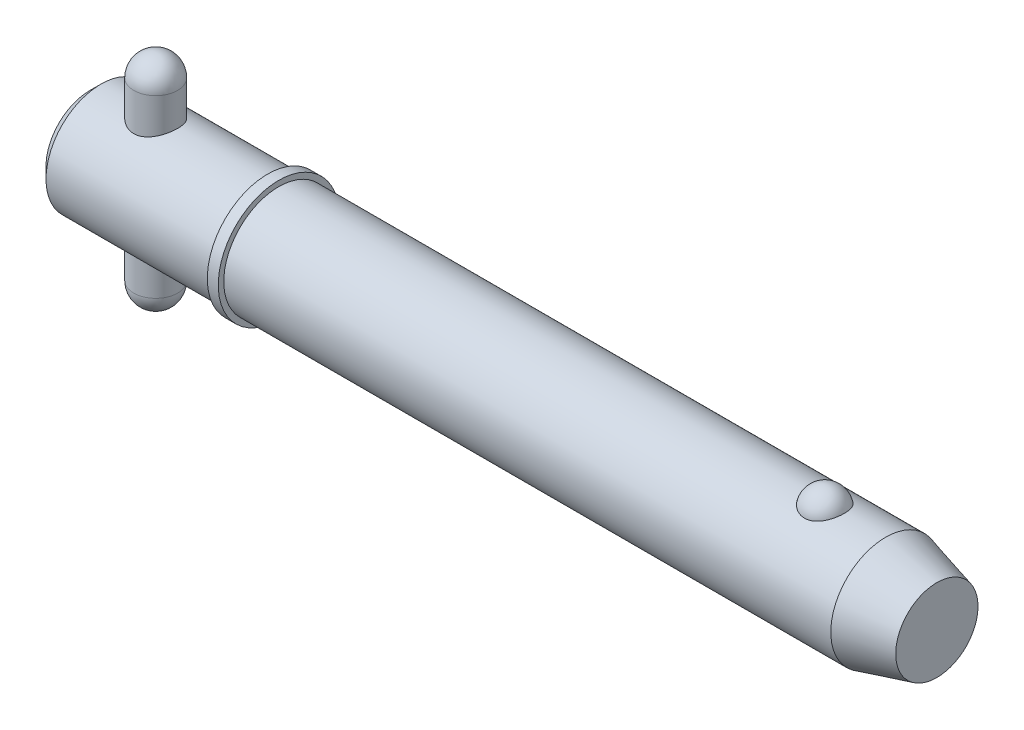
ISO-10303-21;
HEADER;
FILE_DESCRIPTION(('STEP AP214'),'2;1');
FILE_NAME('part.step','',(''),(''),'','','');
FILE_SCHEMA(('AUTOMOTIVE_DESIGN { 1 0 10303 214 1 1 1 1 }'));
ENDSEC;
DATA;
#1=APPLICATION_CONTEXT('core data for automotive mechanical design processes');
#2=APPLICATION_PROTOCOL_DEFINITION('international standard','automotive_design',2000,#1);
#3=PRODUCT_CONTEXT('',#1,'mechanical');
#4=PRODUCT('Part','Part','',(#3));
#5=PRODUCT_RELATED_PRODUCT_CATEGORY('part','',(#4));
#6=PRODUCT_DEFINITION_FORMATION('','',#4);
#7=PRODUCT_DEFINITION_CONTEXT('part definition',#1,'design');
#8=PRODUCT_DEFINITION('design','',#6,#7);
#9=PRODUCT_DEFINITION_SHAPE('','',#8);
#10=(LENGTH_UNIT() NAMED_UNIT(*) SI_UNIT(.MILLI.,.METRE.));
#11=(NAMED_UNIT(*) PLANE_ANGLE_UNIT() SI_UNIT($,.RADIAN.));
#12=(NAMED_UNIT(*) SI_UNIT($,.STERADIAN.) SOLID_ANGLE_UNIT());
#13=UNCERTAINTY_MEASURE_WITH_UNIT(LENGTH_MEASURE(1.E-05),#10,'distance_accuracy_value','');
#14=(GEOMETRIC_REPRESENTATION_CONTEXT(3) GLOBAL_UNCERTAINTY_ASSIGNED_CONTEXT((#13)) GLOBAL_UNIT_ASSIGNED_CONTEXT((#10,
#11,#12)) REPRESENTATION_CONTEXT('',''));
#15=CARTESIAN_POINT('',(0.,0.,0.));
#16=DIRECTION('',(0.,0.,1.));
#17=DIRECTION('',(1.,0.,0.));
#18=AXIS2_PLACEMENT_3D('',#15,#16,#17);
#19=CARTESIAN_POINT('',(9.525,15.875,0.));
#20=DIRECTION('',(0.,-1.,0.));
#21=DIRECTION('',(0.,0.,-1.));
#22=AXIS2_PLACEMENT_3D('',#19,#20,#21);
#23=CYLINDRICAL_SURFACE('',#22,3.175);
#24=CARTESIAN_POINT('',(9.525,-12.7,0.));
#25=DIRECTION('',(0.,-1.,0.));
#26=DIRECTION('',(0.,0.,-1.));
#27=AXIS2_PLACEMENT_3D('',#24,#25,#26);
#28=CIRCLE('',#27,3.175);
#29=CARTESIAN_POINT('',(9.525,-12.7,-3.175));
#30=VERTEX_POINT('',#29);
#31=EDGE_CURVE('P0_E10',#30,#30,#28,.F.);
#32=ORIENTED_EDGE('',*,*,#31,.T.);
#33=EDGE_LOOP('',(#32));
#34=FACE_BOUND('',#33,.T.);
#35=CARTESIAN_POINT('',(9.525,12.7,0.));
#36=DIRECTION('',(0.,-1.,0.));
#37=DIRECTION('',(0.,0.,-1.));
#38=AXIS2_PLACEMENT_3D('',#35,#36,#37);
#39=CIRCLE('',#38,3.175);
#40=CARTESIAN_POINT('',(9.525,12.7,-3.175));
#41=VERTEX_POINT('',#40);
#42=EDGE_CURVE('P0_E21',#41,#41,#39,.T.);
#43=ORIENTED_EDGE('',*,*,#42,.T.);
#44=EDGE_LOOP('',(#43));
#45=FACE_BOUND('',#44,.T.);
#46=ADVANCED_FACE('P0_F14',(#34,#45),#23,.T.);
#47=CARTESIAN_POINT('',(9.525,-12.7,0.));
#48=DIRECTION('',(0.,0.,1.));
#49=DIRECTION('',(1.,0.,0.));
#50=AXIS2_PLACEMENT_3D('',#47,#48,#49);
#51=SPHERICAL_SURFACE('',#50,3.175);
#52=CARTESIAN_POINT('',(9.525,-12.7,0.));
#53=DIRECTION('',(0.,-1.,0.));
#54=DIRECTION('',(0.,0.,-1.));
#55=AXIS2_PLACEMENT_3D('',#52,#53,#54);
#56=SPHERICAL_SURFACE('',#55,3.175);
#57=ORIENTED_EDGE('',*,*,#31,.F.);
#58=EDGE_LOOP('',(#57));
#59=FACE_BOUND('',#58,.T.);
#60=ADVANCED_FACE('P0_F29',(#59),#56,.T.);
#61=CARTESIAN_POINT('',(9.525,12.7,0.));
#62=DIRECTION('',(0.,0.,1.));
#63=DIRECTION('',(1.,0.,0.));
#64=AXIS2_PLACEMENT_3D('',#61,#62,#63);
#65=SPHERICAL_SURFACE('',#64,3.175);
#66=CARTESIAN_POINT('',(9.525,12.7,0.));
#67=DIRECTION('',(0.,-1.,0.));
#68=DIRECTION('',(0.,0.,-1.));
#69=AXIS2_PLACEMENT_3D('',#66,#67,#68);
#70=SPHERICAL_SURFACE('',#69,3.175);
#71=ORIENTED_EDGE('',*,*,#42,.F.);
#72=EDGE_LOOP('',(#71));
#73=FACE_BOUND('',#72,.T.);
#74=ADVANCED_FACE('P0_F16',(#73),#70,.T.);
#75=CLOSED_SHELL('',(#46,#60,#74));
#76=MANIFOLD_SOLID_BREP('P0_B1',#75);
#77=CARTESIAN_POINT('',(0.,0.,0.));
#78=DIRECTION('',(1.,0.,0.));
#79=DIRECTION('',(0.,0.,-1.));
#80=AXIS2_PLACEMENT_3D('',#77,#78,#79);
#81=CYLINDRICAL_SURFACE('',#80,7.94);
#82=CARTESIAN_POINT('',(115.151879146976,0.,0.));
#83=DIRECTION('',(1.,0.,0.));
#84=DIRECTION('',(0.,0.,-1.));
#85=AXIS2_PLACEMENT_3D('',#82,#83,#84);
#86=CIRCLE('',#85,7.94);
#87=CARTESIAN_POINT('',(115.151879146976,0.,-7.94));
#88=VERTEX_POINT('',#87);
#89=EDGE_CURVE('P1_E81',#88,#88,#86,.T.);
#90=ORIENTED_EDGE('',*,*,#89,.F.);
#91=EDGE_LOOP('',(#90));
#92=FACE_BOUND('',#91,.T.);
#93=CARTESIAN_POINT('',(27.31,0.,0.));
#94=DIRECTION('',(1.,0.,0.));
#95=DIRECTION('',(0.,0.,-1.));
#96=AXIS2_PLACEMENT_3D('',#93,#94,#95);
#97=CIRCLE('',#96,7.94);
#98=CARTESIAN_POINT('',(27.31,0.,-7.94));
#99=VERTEX_POINT('',#98);
#100=EDGE_CURVE('P1_E85',#99,#99,#97,.T.);
#101=ORIENTED_EDGE('',*,*,#100,.T.);
#102=EDGE_LOOP('',(#101));
#103=FACE_BOUND('',#102,.T.);
#104=CARTESIAN_POINT('',(106.344907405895,7.37767842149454,2.93486986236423));
#105=CARTESIAN_POINT('',(106.192749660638,7.3776732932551,2.93487505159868));
#106=CARTESIAN_POINT('',(106.040632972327,7.38258419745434,2.92262454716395));
#107=CARTESIAN_POINT('',(105.740928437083,7.40163229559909,2.87404196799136));
#108=CARTESIAN_POINT('',(105.593339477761,7.41576720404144,2.83771585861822));
#109=CARTESIAN_POINT('',(105.307018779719,7.4516157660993,2.74218769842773));
#110=CARTESIAN_POINT('',(105.168274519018,7.47331841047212,2.68301886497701));
#111=CARTESIAN_POINT('',(104.902882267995,7.52194082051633,2.54350967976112));
#112=CARTESIAN_POINT('',(104.776236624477,7.5488615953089,2.46316523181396));
#113=CARTESIAN_POINT('',(104.534534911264,7.60594671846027,2.28090375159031));
#114=CARTESIAN_POINT('',(104.419906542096,7.63618114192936,2.17844211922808));
#115=CARTESIAN_POINT('',(104.208878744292,7.69614046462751,1.95608495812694));
#116=CARTESIAN_POINT('',(104.112482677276,7.72586526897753,1.83618622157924));
#117=CARTESIAN_POINT('',(103.935938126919,7.78314821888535,1.57628086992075));
#118=CARTESIAN_POINT('',(103.856707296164,7.81055035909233,1.43561546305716));
#119=CARTESIAN_POINT('',(103.721797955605,7.85879631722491,1.14236334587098));
#120=CARTESIAN_POINT('',(103.666121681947,7.87963951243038,0.989775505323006));
#121=CARTESIAN_POINT('',(103.57881215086,7.91289645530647,0.67461992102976));
#122=CARTESIAN_POINT('',(103.54753090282,7.925186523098,0.511941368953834));
#123=CARTESIAN_POINT('',(103.510975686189,7.93958930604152,0.183247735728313));
#124=CARTESIAN_POINT('',(103.505701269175,7.94170219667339,0.0172327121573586));
#125=CARTESIAN_POINT('',(103.521231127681,7.93554931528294,-0.312672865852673));
#126=CARTESIAN_POINT('',(103.541925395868,7.92732732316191,-0.476569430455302));
#127=CARTESIAN_POINT('',(103.60878655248,7.90141534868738,-0.798305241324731));
#128=CARTESIAN_POINT('',(103.654953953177,7.88372517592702,-0.956144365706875));
#129=CARTESIAN_POINT('',(103.771898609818,7.84066230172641,-1.26152073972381));
#130=CARTESIAN_POINT('',(103.842704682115,7.81528060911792,-1.40904568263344));
#131=CARTESIAN_POINT('',(104.007478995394,7.7594867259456,-1.68950598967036));
#132=CARTESIAN_POINT('',(104.101448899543,7.72907417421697,-1.82244030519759));
#133=CARTESIAN_POINT('',(104.310839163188,7.66640424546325,-2.07032792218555));
#134=CARTESIAN_POINT('',(104.426315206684,7.63414223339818,-2.1852330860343));
#135=CARTESIAN_POINT('',(104.6759006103,7.57149681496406,-2.39329737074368));
#136=CARTESIAN_POINT('',(104.810008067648,7.54111321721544,-2.48645870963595));
#137=CARTESIAN_POINT('',(105.090111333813,7.48650742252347,-2.64628132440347));
#138=CARTESIAN_POINT('',(105.235760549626,7.46215900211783,-2.71350554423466));
#139=CARTESIAN_POINT('',(105.537425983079,7.42171253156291,-2.82226614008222));
#140=CARTESIAN_POINT('',(105.693438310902,7.40561140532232,-2.86381209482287));
#141=CARTESIAN_POINT('',(106.002970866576,7.3842679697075,-2.91839077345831));
#142=CARTESIAN_POINT('',(106.156222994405,7.37852109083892,-2.93275024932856));
#143=CARTESIAN_POINT('',(106.463070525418,7.37700973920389,-2.93655208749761));
#144=CARTESIAN_POINT('',(106.616665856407,7.38124333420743,-2.92599927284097));
#145=CARTESIAN_POINT('',(106.914990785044,7.39890635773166,-2.88102897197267));
#146=CARTESIAN_POINT('',(107.059848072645,7.41205491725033,-2.8473399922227));
#147=CARTESIAN_POINT('',(107.34164329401,7.445801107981,-2.75788206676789));
#148=CARTESIAN_POINT('',(107.478580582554,7.46639934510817,-2.70211132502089));
#149=CARTESIAN_POINT('',(107.744061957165,7.51339098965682,-2.56858908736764));
#150=CARTESIAN_POINT('',(107.872354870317,7.53990200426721,-2.49038067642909));
#151=CARTESIAN_POINT('',(108.114244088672,7.59569503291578,-2.31462737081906));
#152=CARTESIAN_POINT('',(108.227837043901,7.62497767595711,-2.21707808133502));
#153=CARTESIAN_POINT('',(108.44322156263,7.68489473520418,-1.99982049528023));
#154=CARTESIAN_POINT('',(108.544148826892,7.71552419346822,-1.87925337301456));
#155=CARTESIAN_POINT('',(108.725186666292,7.77353016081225,-1.62268826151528));
#156=CARTESIAN_POINT('',(108.805293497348,7.80090608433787,-1.4866875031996));
#157=CARTESIAN_POINT('',(108.945361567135,7.85047992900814,-1.19818413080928));
#158=CARTESIAN_POINT('',(109.004587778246,7.8724818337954,-1.04529016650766));
#159=CARTESIAN_POINT('',(109.097982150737,7.90785114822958,-0.731080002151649));
#160=CARTESIAN_POINT('',(109.132149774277,7.92121837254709,-0.569763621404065));
#161=CARTESIAN_POINT('',(109.174795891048,7.93797834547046,-0.242812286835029));
#162=CARTESIAN_POINT('',(109.183204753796,7.94134405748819,-0.0771668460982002));
#163=CARTESIAN_POINT('',(109.173962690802,7.93767937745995,0.2532769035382));
#164=CARTESIAN_POINT('',(109.156312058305,7.93064910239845,0.418075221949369));
#165=CARTESIAN_POINT('',(109.095424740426,7.90695571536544,0.74152553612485));
#166=CARTESIAN_POINT('',(109.052281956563,7.8903279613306,0.900197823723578));
#167=CARTESIAN_POINT('',(108.94135358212,7.84916386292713,1.20759654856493));
#168=CARTESIAN_POINT('',(108.87356656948,7.82462706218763,1.35632241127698));
#169=CARTESIAN_POINT('',(108.714371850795,7.7700669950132,1.64032869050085));
#170=CARTESIAN_POINT('',(108.622861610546,7.7400200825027,1.77554712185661));
#171=CARTESIAN_POINT('',(108.418296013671,7.67774175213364,2.02800648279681));
#172=CARTESIAN_POINT('',(108.305241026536,7.64551037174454,2.14524772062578));
#173=CARTESIAN_POINT('',(108.060831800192,7.58265895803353,2.35778002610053));
#174=CARTESIAN_POINT('',(107.929583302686,7.5520309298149,2.45319004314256));
#175=CARTESIAN_POINT('',(107.651601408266,7.49579792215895,2.61999897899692));
#176=CARTESIAN_POINT('',(107.504867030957,7.47019326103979,2.69139637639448));
#177=CARTESIAN_POINT('',(107.192947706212,7.42622216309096,2.8105324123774));
#178=CARTESIAN_POINT('',(107.027220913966,7.40825002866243,2.85700910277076));
#179=CARTESIAN_POINT('',(106.689279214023,7.38398348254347,2.9191685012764));
#180=CARTESIAN_POINT('',(106.51706702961,7.3776842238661,2.93486399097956));
#181=CARTESIAN_POINT('',(106.344907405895,7.37767842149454,2.93486986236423));
#182=B_SPLINE_CURVE_WITH_KNOTS('',3,(#104,#105,#106,#107,#108,#109,#110,#111,#112,#113,#114,
#115,#116,#117,#118,#119,#120,#121,#122,#123,#124,#125,#126,#127,#128,#129,#130,#131,#132,#133,
#134,#135,#136,#137,#138,#139,#140,#141,#142,#143,#144,#145,#146,#147,#148,#149,#150,#151,#152,
#153,#154,#155,#156,#157,#158,#159,#160,#161,#162,#163,#164,#165,#166,#167,#168,#169,#170,#171,
#172,#173,#174,#175,#176,#177,#178,#179,#180,#181),.UNSPECIFIED.,.T.,.F.,(4,2,2,2,2,2,2,2,2,2,2,
2,2,2,2,2,2,2,2,2,2,2,2,2,2,2,2,2,2,2,2,2,2,2,2,2,2,2,4),(0.,0.45584132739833,0.911569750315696,
1.36663794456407,1.8217942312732,2.28978983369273,2.7578716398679,3.246853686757,
3.73588214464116,4.23184282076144,4.72779494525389,5.22165321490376,5.71552141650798,
6.20996917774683,6.70445245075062,7.20023431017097,7.69596557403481,8.18023418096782,
8.66432203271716,9.12410697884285,9.58380291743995,10.0296503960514,10.4755341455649,
10.9312349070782,11.3870393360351,11.8654416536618,12.3439299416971,12.8378875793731,
13.3318558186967,13.8271581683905,14.3224549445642,14.8159385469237,15.3094506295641,
15.8051323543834,16.3008055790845,16.7937101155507,17.2866458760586,17.8026240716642,
18.3183879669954),.UNSPECIFIED.);
#183=CARTESIAN_POINT('',(106.344907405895,7.37767842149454,2.93486986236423));
#184=VERTEX_POINT('',#183);
#185=EDGE_CURVE('P1_E35',#184,#184,#182,.T.);
#186=ORIENTED_EDGE('',*,*,#185,.T.);
#187=EDGE_LOOP('',(#186));
#188=FACE_BOUND('',#187,.T.);
#189=ADVANCED_FACE('P1_F13',(#92,#103,#188),#81,.T.);
#190=CARTESIAN_POINT('',(0.,0.,0.));
#191=DIRECTION('',(-1.,0.,0.));
#192=DIRECTION('',(0.,0.,1.));
#193=AXIS2_PLACEMENT_3D('',#190,#191,#192);
#194=PLANE('',#193);
#195=CARTESIAN_POINT('',(0.,0.,0.));
#196=DIRECTION('',(1.,0.,0.));
#197=DIRECTION('',(0.,0.,-1.));
#198=AXIS2_PLACEMENT_3D('',#195,#196,#197);
#199=CIRCLE('',#198,6.352);
#200=CARTESIAN_POINT('',(0.,0.,-6.352));
#201=VERTEX_POINT('',#200);
#202=EDGE_CURVE('P1_E9',#201,#201,#199,.T.);
#203=ORIENTED_EDGE('',*,*,#202,.F.);
#204=EDGE_LOOP('',(#203));
#205=FACE_BOUND('',#204,.T.);
#206=ADVANCED_FACE('P1_F15',(#205),#194,.T.);
#207=CARTESIAN_POINT('',(1.58799999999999,0.,0.));
#208=DIRECTION('',(1.,0.,0.));
#209=DIRECTION('',(0.,0.,-1.));
#210=AXIS2_PLACEMENT_3D('',#207,#208,#209);
#211=CONICAL_SURFACE('',#210,7.94,0.78539816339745);
#212=ORIENTED_EDGE('',*,*,#202,.T.);
#213=EDGE_LOOP('',(#212));
#214=FACE_BOUND('',#213,.T.);
#215=CARTESIAN_POINT('',(1.58799999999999,0.,0.));
#216=DIRECTION('',(1.,0.,0.));
#217=DIRECTION('',(0.,0.,-1.));
#218=AXIS2_PLACEMENT_3D('',#215,#216,#217);
#219=CIRCLE('',#218,7.94);
#220=CARTESIAN_POINT('',(1.58799999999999,0.,-7.94));
#221=VERTEX_POINT('',#220);
#222=EDGE_CURVE('P1_E26',#221,#221,#219,.T.);
#223=ORIENTED_EDGE('',*,*,#222,.F.);
#224=EDGE_LOOP('',(#223));
#225=FACE_BOUND('',#224,.T.);
#226=ADVANCED_FACE('P1_F77',(#214,#225),#211,.T.);
#227=CARTESIAN_POINT('',(0.,0.,0.));
#228=DIRECTION('',(1.,0.,0.));
#229=DIRECTION('',(0.,0.,-1.));
#230=AXIS2_PLACEMENT_3D('',#227,#228,#229);
#231=CYLINDRICAL_SURFACE('',#230,7.94);
#232=CARTESIAN_POINT('',(9.525,-7.27756655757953,3.175));
#233=CARTESIAN_POINT('',(9.43992346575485,-7.27756715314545,3.17499935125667));
#234=CARTESIAN_POINT('',(9.35481882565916,-7.27906496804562,3.1715736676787));
#235=CARTESIAN_POINT('',(9.18524505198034,-7.28499816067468,3.15791803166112));
#236=CARTESIAN_POINT('',(9.100776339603,-7.28943533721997,3.14768391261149));
#237=CARTESIAN_POINT('',(8.84895715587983,-7.30698881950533,3.10684226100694));
#238=CARTESIAN_POINT('',(8.6834173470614,-7.32434654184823,3.06609574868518));
#239=CARTESIAN_POINT('',(8.36278910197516,-7.36806950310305,2.95945910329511));
#240=CARTESIAN_POINT('',(8.20766386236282,-7.39440078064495,2.89366366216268));
#241=CARTESIAN_POINT('',(7.91065319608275,-7.45304562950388,2.73907413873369));
#242=CARTESIAN_POINT('',(7.76876488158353,-7.48535789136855,2.65028508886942));
#243=CARTESIAN_POINT('',(7.49411086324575,-7.55439482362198,2.44679888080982));
#244=CARTESIAN_POINT('',(7.36219910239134,-7.59126138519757,2.33099745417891));
#245=CARTESIAN_POINT('',(7.11904234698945,-7.66408045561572,2.07909838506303));
#246=CARTESIAN_POINT('',(7.00780457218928,-7.70003264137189,1.94299368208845));
#247=CARTESIAN_POINT('',(6.80492173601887,-7.76867514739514,1.64775981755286));
#248=CARTESIAN_POINT('',(6.71422139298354,-7.80118112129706,1.48793473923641));
#249=CARTESIAN_POINT('',(6.56135788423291,-7.85754918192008,1.15376269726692));
#250=CARTESIAN_POINT('',(6.49918311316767,-7.88141478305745,0.979421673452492));
#251=CARTESIAN_POINT('',(6.40818142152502,-7.91680873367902,0.630115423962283));
#252=CARTESIAN_POINT('',(6.3778864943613,-7.9288781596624,0.455588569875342));
#253=CARTESIAN_POINT('',(6.34677743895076,-7.94127547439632,0.103539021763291));
#254=CARTESIAN_POINT('',(6.34595232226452,-7.94160773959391,-0.0739825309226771));
#255=CARTESIAN_POINT('',(6.37300128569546,-7.93082261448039,-0.416371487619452));
#256=CARTESIAN_POINT('',(6.39926693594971,-7.92034690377,-0.581389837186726));
#257=CARTESIAN_POINT('',(6.47701615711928,-7.88998770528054,-0.904449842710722));
#258=CARTESIAN_POINT('',(6.52850157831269,-7.87010352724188,-1.06249098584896));
#259=CARTESIAN_POINT('',(6.65586120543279,-7.82249343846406,-1.36995769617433));
#260=CARTESIAN_POINT('',(6.73209124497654,-7.79465387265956,-1.51921754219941));
#261=CARTESIAN_POINT('',(6.90644286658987,-7.73389606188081,-1.80321183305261));
#262=CARTESIAN_POINT('',(7.00457194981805,-7.70097607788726,-1.93794127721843));
#263=CARTESIAN_POINT('',(7.22744086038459,-7.63084889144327,-2.19843606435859));
#264=CARTESIAN_POINT('',(7.35350432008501,-7.59350211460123,-2.3230330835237));
#265=CARTESIAN_POINT('',(7.62488266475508,-7.52039654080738,-2.54979642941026));
#266=CARTESIAN_POINT('',(7.77020381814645,-7.48463826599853,-2.65195542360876));
#267=CARTESIAN_POINT('',(8.08119298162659,-7.41780943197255,-2.83361305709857));
#268=CARTESIAN_POINT('',(8.24731937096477,-7.38689959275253,-2.91239105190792));
#269=CARTESIAN_POINT('',(8.59204539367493,-7.33515216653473,-3.04038913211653));
#270=CARTESIAN_POINT('',(8.77063684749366,-7.31430804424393,-3.08962840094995));
#271=CARTESIAN_POINT('',(9.12356982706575,-7.28663831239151,-3.15431018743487));
#272=CARTESIAN_POINT('',(9.29750494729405,-7.2790344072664,-3.17163284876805));
#273=CARTESIAN_POINT('',(9.64592502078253,-7.27648884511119,-3.17747282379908));
#274=CARTESIAN_POINT('',(9.82040979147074,-7.28154335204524,-3.16599886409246));
#275=CARTESIAN_POINT('',(10.1545374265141,-7.30294638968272,-3.11628310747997));
#276=CARTESIAN_POINT('',(10.3144598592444,-7.31863587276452,-3.0796016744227));
#277=CARTESIAN_POINT('',(10.625774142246,-7.35872371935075,-2.98253618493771));
#278=CARTESIAN_POINT('',(10.7771640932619,-7.38312401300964,-2.92214687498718));
#279=CARTESIAN_POINT('',(11.0739599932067,-7.4390944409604,-2.77664664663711));
#280=CARTESIAN_POINT('',(11.2188745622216,-7.47091513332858,-2.69063278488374));
#281=CARTESIAN_POINT('',(11.4928722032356,-7.53775867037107,-2.49724834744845));
#282=CARTESIAN_POINT('',(11.6219487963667,-7.57278281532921,-2.38986907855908));
#283=CARTESIAN_POINT('',(11.8705091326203,-7.64520845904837,-2.1474449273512));
#284=CARTESIAN_POINT('',(11.9885816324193,-7.68259462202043,-2.01094304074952));
#285=CARTESIAN_POINT('',(12.2003631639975,-7.75309951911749,-1.71917041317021));
#286=CARTESIAN_POINT('',(12.2940712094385,-7.78621808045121,-1.56389891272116));
#287=CARTESIAN_POINT('',(12.4541161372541,-7.84456050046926,-1.23845027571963));
#288=CARTESIAN_POINT('',(12.5204600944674,-7.86978639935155,-1.06827700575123));
#289=CARTESIAN_POINT('',(12.6231407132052,-7.90943635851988,-0.717928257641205));
#290=CARTESIAN_POINT('',(12.6594936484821,-7.92386627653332,-0.537758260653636));
#291=CARTESIAN_POINT('',(12.6992281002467,-7.93967263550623,-0.185201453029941));
#292=CARTESIAN_POINT('',(12.7046050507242,-7.94183891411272,-0.0130732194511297));
#293=CARTESIAN_POINT('',(12.6875036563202,-7.9350072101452,0.329549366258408));
#294=CARTESIAN_POINT('',(12.6650295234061,-7.92601091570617,0.500043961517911));
#295=CARTESIAN_POINT('',(12.5942896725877,-7.89825976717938,0.829196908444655));
#296=CARTESIAN_POINT('',(12.5468364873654,-7.87981280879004,0.988057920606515));
#297=CARTESIAN_POINT('',(12.4283390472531,-7.83513565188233,1.29553461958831));
#298=CARTESIAN_POINT('',(12.3572904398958,-7.8089040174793,1.44414841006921));
#299=CARTESIAN_POINT('',(12.1900822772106,-7.7497911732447,1.73412879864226));
#300=CARTESIAN_POINT('',(12.0929519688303,-7.71666737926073,1.87488510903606));
#301=CARTESIAN_POINT('',(11.8777894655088,-7.64775894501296,2.13869231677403));
#302=CARTESIAN_POINT('',(11.7597486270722,-7.61197320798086,2.26173585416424));
#303=CARTESIAN_POINT('',(11.4974896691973,-7.53902341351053,2.49449755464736));
#304=CARTESIAN_POINT('',(11.3521039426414,-7.50191102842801,2.60292060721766));
#305=CARTESIAN_POINT('',(11.0440201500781,-7.43289551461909,2.79392602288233));
#306=CARTESIAN_POINT('',(10.8813200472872,-7.40099299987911,2.87650534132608));
#307=CARTESIAN_POINT('',(10.558064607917,-7.3489506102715,3.00682739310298));
#308=CARTESIAN_POINT('',(10.398627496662,-7.32801197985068,3.05703164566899));
#309=CARTESIAN_POINT('',(10.0731242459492,-7.29639491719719,3.13175843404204));
#310=CARTESIAN_POINT('',(9.90707793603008,-7.28568789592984,3.15635254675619));
#311=CARTESIAN_POINT('',(9.70441566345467,-7.27968826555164,3.17013149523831));
#312=CARTESIAN_POINT('',(9.66856669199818,-7.27889378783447,3.17195593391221));
#313=CARTESIAN_POINT('',(9.59681348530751,-7.27783278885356,3.17439036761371));
#314=CARTESIAN_POINT('',(9.56090924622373,-7.27756630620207,3.17500027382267));
#315=CARTESIAN_POINT('',(9.525,-7.27756655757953,3.175));
#316=B_SPLINE_CURVE_WITH_KNOTS('',3,(#232,#233,#234,#235,#236,#237,#238,#239,#240,#241,#242,
#243,#244,#245,#246,#247,#248,#249,#250,#251,#252,#253,#254,#255,#256,#257,#258,#259,#260,#261,
#262,#263,#264,#265,#266,#267,#268,#269,#270,#271,#272,#273,#274,#275,#276,#277,#278,#279,#280,
#281,#282,#283,#284,#285,#286,#287,#288,#289,#290,#291,#292,#293,#294,#295,#296,#297,#298,#299,
#300,#301,#302,#303,#304,#305,#306,#307,#308,#309,#310,#311,#312,#313,#314,#315),.UNSPECIFIED.,
.T.,.F.,(4,2,2,2,2,2,2,2,2,2,2,2,2,2,2,2,2,2,2,2,2,2,2,2,2,2,2,2,2,2,2,2,2,2,2,2,2,2,2,2,2,4),
(0.,0.255187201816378,0.510530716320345,1.0218798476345,1.53131482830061,2.04063840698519,
2.57635929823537,3.11226692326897,3.66929090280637,4.22608806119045,4.75594400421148,
5.28560237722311,5.78552836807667,6.28549104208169,6.79298787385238,7.30065880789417,
7.8416422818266,8.38280228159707,8.93923025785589,9.49529647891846,10.0174074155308,
10.5393601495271,11.0316114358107,11.5239718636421,12.0362920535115,12.5488211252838,
13.0991799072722,13.6495609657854,14.1997996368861,14.7497395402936,15.2638187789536,
15.7778202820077,16.2760504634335,16.7743726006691,17.294711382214,17.8152657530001,
18.3680208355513,18.9208410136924,19.4240423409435,19.9258334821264,20.0335354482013,
20.1412452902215),.UNSPECIFIED.);
#317=CARTESIAN_POINT('',(9.525,-7.27756655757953,3.175));
#318=VERTEX_POINT('',#317);
#319=EDGE_CURVE('P1_E17',#318,#318,#316,.T.);
#320=ORIENTED_EDGE('',*,*,#319,.F.);
#321=EDGE_LOOP('',(#320));
#322=FACE_BOUND('',#321,.T.);
#323=CARTESIAN_POINT('',(9.525,7.27756655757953,3.175));
#324=CARTESIAN_POINT('',(9.61007653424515,7.27756715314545,3.17499935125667));
#325=CARTESIAN_POINT('',(9.69518117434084,7.27906496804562,3.1715736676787));
#326=CARTESIAN_POINT('',(9.86475494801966,7.28499816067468,3.15791803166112));
#327=CARTESIAN_POINT('',(9.949223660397,7.28943533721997,3.14768391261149));
#328=CARTESIAN_POINT('',(10.2010428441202,7.30698881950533,3.10684226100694));
#329=CARTESIAN_POINT('',(10.3665826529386,7.32434654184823,3.06609574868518));
#330=CARTESIAN_POINT('',(10.6872108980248,7.36806950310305,2.95945910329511));
#331=CARTESIAN_POINT('',(10.8423361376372,7.39440078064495,2.89366366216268));
#332=CARTESIAN_POINT('',(11.1393468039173,7.45304562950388,2.73907413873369));
#333=CARTESIAN_POINT('',(11.2812351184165,7.48535789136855,2.65028508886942));
#334=CARTESIAN_POINT('',(11.5558891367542,7.55439482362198,2.44679888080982));
#335=CARTESIAN_POINT('',(11.6878008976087,7.59126138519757,2.33099745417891));
#336=CARTESIAN_POINT('',(11.9309576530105,7.66408045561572,2.07909838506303));
#337=CARTESIAN_POINT('',(12.0421954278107,7.70003264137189,1.94299368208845));
#338=CARTESIAN_POINT('',(12.2450782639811,7.76867514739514,1.64775981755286));
#339=CARTESIAN_POINT('',(12.3357786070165,7.80118112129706,1.48793473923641));
#340=CARTESIAN_POINT('',(12.4886421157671,7.85754918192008,1.15376269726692));
#341=CARTESIAN_POINT('',(12.5508168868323,7.88141478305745,0.979421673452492));
#342=CARTESIAN_POINT('',(12.641818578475,7.91680873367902,0.630115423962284));
#343=CARTESIAN_POINT('',(12.6721135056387,7.9288781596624,0.455588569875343));
#344=CARTESIAN_POINT('',(12.7032225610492,7.94127547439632,0.103539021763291));
#345=CARTESIAN_POINT('',(12.7040476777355,7.94160773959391,-0.0739825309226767));
#346=CARTESIAN_POINT('',(12.6769987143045,7.93082261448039,-0.416371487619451));
#347=CARTESIAN_POINT('',(12.6507330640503,7.92034690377,-0.581389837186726));
#348=CARTESIAN_POINT('',(12.5729838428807,7.88998770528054,-0.904449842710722));
#349=CARTESIAN_POINT('',(12.5214984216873,7.87010352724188,-1.06249098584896));
#350=CARTESIAN_POINT('',(12.3941387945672,7.82249343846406,-1.36995769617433));
#351=CARTESIAN_POINT('',(12.3179087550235,7.79465387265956,-1.51921754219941));
#352=CARTESIAN_POINT('',(12.1435571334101,7.73389606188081,-1.80321183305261));
#353=CARTESIAN_POINT('',(12.0454280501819,7.70097607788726,-1.93794127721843));
#354=CARTESIAN_POINT('',(11.8225591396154,7.63084889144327,-2.19843606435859));
#355=CARTESIAN_POINT('',(11.696495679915,7.59350211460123,-2.3230330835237));
#356=CARTESIAN_POINT('',(11.4251173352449,7.52039654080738,-2.54979642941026));
#357=CARTESIAN_POINT('',(11.2797961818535,7.48463826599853,-2.65195542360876));
#358=CARTESIAN_POINT('',(10.9688070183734,7.41780943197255,-2.83361305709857));
#359=CARTESIAN_POINT('',(10.8026806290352,7.38689959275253,-2.91239105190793));
#360=CARTESIAN_POINT('',(10.4579546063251,7.33515216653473,-3.04038913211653));
#361=CARTESIAN_POINT('',(10.2793631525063,7.31430804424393,-3.08962840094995));
#362=CARTESIAN_POINT('',(9.92643017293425,7.28663831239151,-3.15431018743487));
#363=CARTESIAN_POINT('',(9.75249505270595,7.2790344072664,-3.17163284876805));
#364=CARTESIAN_POINT('',(9.40407497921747,7.2764888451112,-3.17747282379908));
#365=CARTESIAN_POINT('',(9.22959020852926,7.28154335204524,-3.16599886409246));
#366=CARTESIAN_POINT('',(8.89546257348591,7.30294638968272,-3.11628310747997));
#367=CARTESIAN_POINT('',(8.73554014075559,7.31863587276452,-3.0796016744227));
#368=CARTESIAN_POINT('',(8.42422585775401,7.35872371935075,-2.98253618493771));
#369=CARTESIAN_POINT('',(8.27283590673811,7.38312401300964,-2.92214687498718));
#370=CARTESIAN_POINT('',(7.97604000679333,7.4390944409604,-2.77664664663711));
#371=CARTESIAN_POINT('',(7.83112543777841,7.47091513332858,-2.69063278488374));
#372=CARTESIAN_POINT('',(7.55712779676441,7.53775867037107,-2.49724834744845));
#373=CARTESIAN_POINT('',(7.42805120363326,7.57278281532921,-2.38986907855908));
#374=CARTESIAN_POINT('',(7.17949086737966,7.64520845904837,-2.1474449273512));
#375=CARTESIAN_POINT('',(7.06141836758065,7.68259462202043,-2.01094304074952));
#376=CARTESIAN_POINT('',(6.8496368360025,7.75309951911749,-1.71917041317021));
#377=CARTESIAN_POINT('',(6.75592879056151,7.78621808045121,-1.56389891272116));
#378=CARTESIAN_POINT('',(6.59588386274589,7.84456050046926,-1.23845027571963));
#379=CARTESIAN_POINT('',(6.52953990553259,7.86978639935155,-1.06827700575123));
#380=CARTESIAN_POINT('',(6.42685928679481,7.90943635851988,-0.717928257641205));
#381=CARTESIAN_POINT('',(6.39050635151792,7.92386627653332,-0.537758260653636));
#382=CARTESIAN_POINT('',(6.35077189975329,7.93967263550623,-0.18520145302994));
#383=CARTESIAN_POINT('',(6.34539494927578,7.94183891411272,-0.0130732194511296));
#384=CARTESIAN_POINT('',(6.36249634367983,7.9350072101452,0.329549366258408));
#385=CARTESIAN_POINT('',(6.38497047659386,7.92601091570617,0.500043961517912));
#386=CARTESIAN_POINT('',(6.45571032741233,7.89825976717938,0.829196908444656));
#387=CARTESIAN_POINT('',(6.50316351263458,7.87981280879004,0.988057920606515));
#388=CARTESIAN_POINT('',(6.62166095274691,7.83513565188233,1.29553461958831));
#389=CARTESIAN_POINT('',(6.69270956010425,7.8089040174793,1.44414841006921));
#390=CARTESIAN_POINT('',(6.85991772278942,7.7497911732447,1.73412879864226));
#391=CARTESIAN_POINT('',(6.95704803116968,7.71666737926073,1.87488510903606));
#392=CARTESIAN_POINT('',(7.17221053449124,7.64775894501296,2.13869231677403));
#393=CARTESIAN_POINT('',(7.29025137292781,7.61197320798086,2.26173585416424));
#394=CARTESIAN_POINT('',(7.55251033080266,7.53902341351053,2.49449755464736));
#395=CARTESIAN_POINT('',(7.69789605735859,7.50191102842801,2.60292060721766));
#396=CARTESIAN_POINT('',(8.00597984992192,7.43289551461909,2.79392602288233));
#397=CARTESIAN_POINT('',(8.16867995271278,7.40099299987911,2.87650534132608));
#398=CARTESIAN_POINT('',(8.49193539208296,7.3489506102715,3.00682739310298));
#399=CARTESIAN_POINT('',(8.65137250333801,7.32801197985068,3.05703164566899));
#400=CARTESIAN_POINT('',(8.97687575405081,7.29639491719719,3.13175843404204));
#401=CARTESIAN_POINT('',(9.14292206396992,7.28568789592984,3.15635254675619));
#402=CARTESIAN_POINT('',(9.34558433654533,7.27968826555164,3.17013149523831));
#403=CARTESIAN_POINT('',(9.38143330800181,7.27889378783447,3.17195593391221));
#404=CARTESIAN_POINT('',(9.45318651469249,7.27783278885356,3.17439036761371));
#405=CARTESIAN_POINT('',(9.48909075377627,7.27756630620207,3.17500027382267));
#406=CARTESIAN_POINT('',(9.525,7.27756655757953,3.175));
#407=B_SPLINE_CURVE_WITH_KNOTS('',3,(#323,#324,#325,#326,#327,#328,#329,#330,#331,#332,#333,
#334,#335,#336,#337,#338,#339,#340,#341,#342,#343,#344,#345,#346,#347,#348,#349,#350,#351,#352,
#353,#354,#355,#356,#357,#358,#359,#360,#361,#362,#363,#364,#365,#366,#367,#368,#369,#370,#371,
#372,#373,#374,#375,#376,#377,#378,#379,#380,#381,#382,#383,#384,#385,#386,#387,#388,#389,#390,
#391,#392,#393,#394,#395,#396,#397,#398,#399,#400,#401,#402,#403,#404,#405,#406),.UNSPECIFIED.,
.T.,.F.,(4,2,2,2,2,2,2,2,2,2,2,2,2,2,2,2,2,2,2,2,2,2,2,2,2,2,2,2,2,2,2,2,2,2,2,2,2,2,2,2,2,4),
(0.,0.255187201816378,0.510530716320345,1.0218798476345,1.53131482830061,2.04063840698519,
2.57635929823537,3.11226692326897,3.66929090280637,4.22608806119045,4.75594400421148,
5.2856023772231,5.78552836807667,6.28549104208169,6.79298787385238,7.30065880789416,
7.8416422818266,8.38280228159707,8.9392302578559,9.49529647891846,10.0174074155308,
10.5393601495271,11.0316114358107,11.5239718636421,12.0362920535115,12.5488211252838,
13.0991799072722,13.6495609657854,14.1997996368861,14.7497395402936,15.2638187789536,
15.7778202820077,16.2760504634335,16.7743726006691,17.294711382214,17.8152657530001,
18.3680208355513,18.9208410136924,19.4240423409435,19.9258334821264,20.0335354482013,
20.1412452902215),.UNSPECIFIED.);
#408=CARTESIAN_POINT('',(9.525,7.27756655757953,3.175));
#409=VERTEX_POINT('',#408);
#410=EDGE_CURVE('P1_E43',#409,#409,#407,.T.);
#411=ORIENTED_EDGE('',*,*,#410,.F.);
#412=EDGE_LOOP('',(#411));
#413=FACE_BOUND('',#412,.T.);
#414=ORIENTED_EDGE('',*,*,#222,.T.);
#415=EDGE_LOOP('',(#414));
#416=FACE_BOUND('',#415,.T.);
#417=CARTESIAN_POINT('',(25.722,0.,0.));
#418=DIRECTION('',(1.,0.,0.));
#419=DIRECTION('',(0.,0.,-1.));
#420=AXIS2_PLACEMENT_3D('',#417,#418,#419);
#421=CIRCLE('',#420,7.94);
#422=CARTESIAN_POINT('',(25.722,0.,-7.94));
#423=VERTEX_POINT('',#422);
#424=EDGE_CURVE('P1_E31',#423,#423,#421,.T.);
#425=ORIENTED_EDGE('',*,*,#424,.F.);
#426=EDGE_LOOP('',(#425));
#427=FACE_BOUND('',#426,.T.);
#428=ADVANCED_FACE('P1_F103',(#322,#413,#416,#427),#231,.T.);
#429=CARTESIAN_POINT('',(25.722,7.94,0.));
#430=DIRECTION('',(-1.,0.,0.));
#431=DIRECTION('',(0.,0.,1.));
#432=AXIS2_PLACEMENT_3D('',#429,#430,#431);
#433=PLANE('',#432);
#434=ORIENTED_EDGE('',*,*,#424,.T.);
#435=EDGE_LOOP('',(#434));
#436=FACE_BOUND('',#435,.T.);
#437=CARTESIAN_POINT('',(25.722,0.,0.));
#438=DIRECTION('',(1.,0.,0.));
#439=DIRECTION('',(0.,0.,-1.));
#440=AXIS2_PLACEMENT_3D('',#437,#438,#439);
#441=CIRCLE('',#440,8.734);
#442=CARTESIAN_POINT('',(25.722,0.,-8.734));
#443=VERTEX_POINT('',#442);
#444=EDGE_CURVE('P1_E91',#443,#443,#441,.T.);
#445=ORIENTED_EDGE('',*,*,#444,.F.);
#446=EDGE_LOOP('',(#445));
#447=FACE_BOUND('',#446,.T.);
#448=ADVANCED_FACE('P1_F100',(#436,#447),#433,.T.);
#449=CARTESIAN_POINT('',(0.,0.,0.));
#450=DIRECTION('',(1.,0.,0.));
#451=DIRECTION('',(0.,0.,-1.));
#452=AXIS2_PLACEMENT_3D('',#449,#450,#451);
#453=CYLINDRICAL_SURFACE('',#452,8.734);
#454=ORIENTED_EDGE('',*,*,#444,.T.);
#455=EDGE_LOOP('',(#454));
#456=FACE_BOUND('',#455,.T.);
#457=CARTESIAN_POINT('',(27.31,0.,0.));
#458=DIRECTION('',(1.,0.,0.));
#459=DIRECTION('',(0.,0.,-1.));
#460=AXIS2_PLACEMENT_3D('',#457,#458,#459);
#461=CIRCLE('',#460,8.734);
#462=CARTESIAN_POINT('',(27.31,0.,-8.734));
#463=VERTEX_POINT('',#462);
#464=EDGE_CURVE('P1_E88',#463,#463,#461,.T.);
#465=ORIENTED_EDGE('',*,*,#464,.F.);
#466=EDGE_LOOP('',(#465));
#467=FACE_BOUND('',#466,.T.);
#468=ADVANCED_FACE('P1_F68',(#456,#467),#453,.T.);
#469=CARTESIAN_POINT('',(27.31,8.734,0.));
#470=DIRECTION('',(1.,0.,0.));
#471=DIRECTION('',(0.,0.,-1.));
#472=AXIS2_PLACEMENT_3D('',#469,#470,#471);
#473=PLANE('',#472);
#474=ORIENTED_EDGE('',*,*,#464,.T.);
#475=EDGE_LOOP('',(#474));
#476=FACE_BOUND('',#475,.T.);
#477=ORIENTED_EDGE('',*,*,#100,.F.);
#478=EDGE_LOOP('',(#477));
#479=FACE_BOUND('',#478,.T.);
#480=ADVANCED_FACE('P1_F62',(#476,#479),#473,.T.);
#481=CARTESIAN_POINT('',(122.56,0.,0.));
#482=DIRECTION('',(-1.,0.,0.));
#483=DIRECTION('',(0.,0.,1.));
#484=AXIS2_PLACEMENT_3D('',#481,#482,#483);
#485=CONICAL_SURFACE('',#484,5.95500000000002,0.26179938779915);
#486=ORIENTED_EDGE('',*,*,#89,.T.);
#487=EDGE_LOOP('',(#486));
#488=FACE_BOUND('',#487,.T.);
#489=CARTESIAN_POINT('',(122.56,0.,0.));
#490=DIRECTION('',(1.,0.,0.));
#491=DIRECTION('',(0.,0.,-1.));
#492=AXIS2_PLACEMENT_3D('',#489,#490,#491);
#493=CIRCLE('',#492,5.95500000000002);
#494=CARTESIAN_POINT('',(122.56,0.,-5.95500000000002));
#495=VERTEX_POINT('',#494);
#496=EDGE_CURVE('P1_E42',#495,#495,#493,.T.);
#497=ORIENTED_EDGE('',*,*,#496,.F.);
#498=EDGE_LOOP('',(#497));
#499=FACE_BOUND('',#498,.T.);
#500=ADVANCED_FACE('P1_F59',(#488,#499),#485,.T.);
#501=CARTESIAN_POINT('',(122.56,5.95500000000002,0.));
#502=DIRECTION('',(1.,0.,0.));
#503=DIRECTION('',(0.,0.,-1.));
#504=AXIS2_PLACEMENT_3D('',#501,#502,#503);
#505=PLANE('',#504);
#506=ORIENTED_EDGE('',*,*,#496,.T.);
#507=EDGE_LOOP('',(#506));
#508=FACE_BOUND('',#507,.T.);
#509=ADVANCED_FACE('P1_F55',(#508),#505,.T.);
#510=CARTESIAN_POINT('',(106.344907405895,7.146,0.));
#511=DIRECTION('',(-1.,0.,0.));
#512=DIRECTION('',(0.,1.,0.));
#513=AXIS2_PLACEMENT_3D('',#510,#511,#512);
#514=SPHERICAL_SURFACE('',#513,2.944);
#515=ORIENTED_EDGE('',*,*,#185,.F.);
#516=EDGE_LOOP('',(#515));
#517=FACE_BOUND('',#516,.T.);
#518=ADVANCED_FACE('P1_F50',(#517),#514,.T.);
#519=CARTESIAN_POINT('',(9.525,-8.734,0.));
#520=DIRECTION('',(0.,1.,0.));
#521=DIRECTION('',(0.,0.,1.));
#522=AXIS2_PLACEMENT_3D('',#519,#520,#521);
#523=CYLINDRICAL_SURFACE('',#522,3.175);
#524=ORIENTED_EDGE('',*,*,#319,.T.);
#525=EDGE_LOOP('',(#524));
#526=FACE_BOUND('',#525,.T.);
#527=ORIENTED_EDGE('',*,*,#410,.T.);
#528=EDGE_LOOP('',(#527));
#529=FACE_BOUND('',#528,.T.);
#530=ADVANCED_FACE('P1_F54',(#526,#529),#523,.F.);
#531=CLOSED_SHELL('',(#189,#206,#226,#428,#448,#468,#480,#500,#509,#518,#530));
#532=MANIFOLD_SOLID_BREP('P1_B1',#531);
#533=ADVANCED_BREP_SHAPE_REPRESENTATION('',(#18,#76,#532),#14);
#534=SHAPE_DEFINITION_REPRESENTATION(#9,#533);
ENDSEC;
END-ISO-10303-21;
